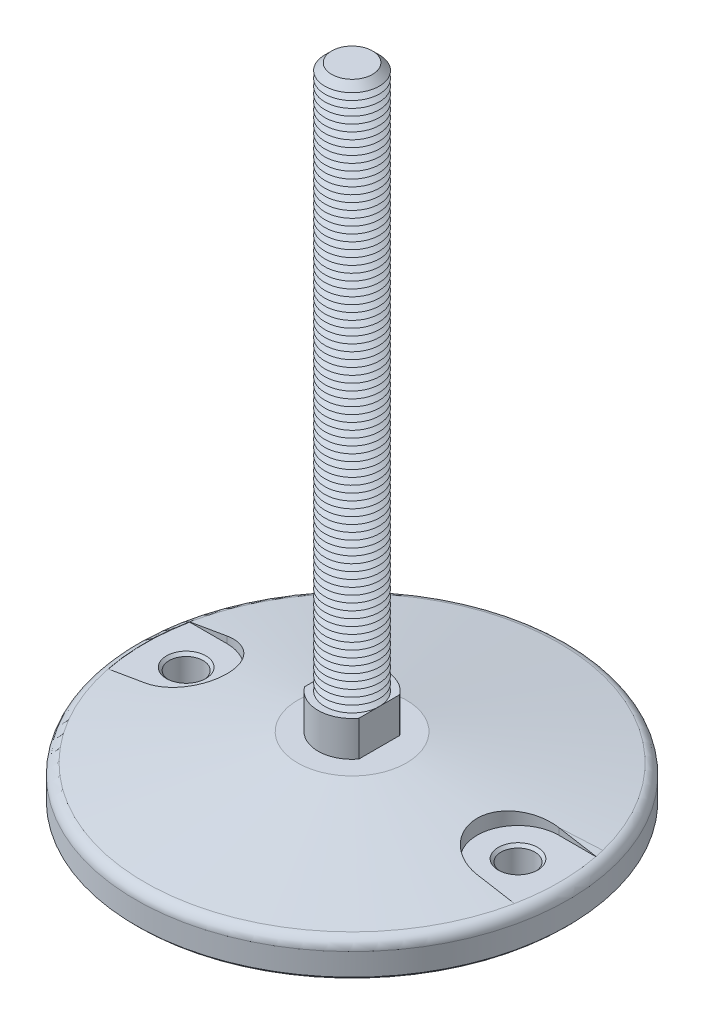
from build123d import *

# Parameters (mm, degrees)
FILLET1_R                = 4
SKETCH3_R                = 12.5
BOSS_EXTRUDE1_DEPTH      = 13
CUT_EXTRUDE1_START       = -13
CUT_EXTRUDE1_DEPTH       = 13
SKETCH5_R                = 10
BOSS_EXTRUDE2_DEPTH      = 200
CHAMFER1_SIZE            = 2.5
LPATTERN1_COUNT          = 79
LPATTERN1_PITCH          = 2.5
CUT_EXTRUDE4_DEPTH       = 10
SKETCH10_R               = 6.25
CUT_EXTRUDE5_DEPTH       = 13
CHAMFER2_SIZE            = 1
CHAMFER2_OF_MIRROR1_SIZE = 1
CHAMFER3_SIZE            = 1


with BuildPart() as part:
    # Sketch2 → Revolve1 (revolve)
    with BuildSketch(Plane(origin=(0, 0, 0), x_dir=(0, 0, -1), z_dir=(1, 0, 0)), mode=Mode.PRIVATE) as revolve1_sk:
        Polygon((0, 0), (-20, 0), (-79.5, -10.491455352), (-79.5, -23), (0, -23), align=None)
    revolve(revolve1_sk.sketch.rotate(Axis((0, 61.338865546, 0), (0, -1, 0)), 180), axis=Axis((0, 61.338865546, 0), (0, -1, 0)))

    # Fillet1
    fillet1_edges = [part.edges().sort_by_distance(p)[0] for p in [
        (0, -10.491455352, 79.5),
    ]]
    fillet(fillet1_edges, radius=FILLET1_R)

    # Sketch3 → Boss-Extrude1 (add)
    with BuildSketch(Plane(origin=(0, 0, 0), x_dir=(1, 0, 0), z_dir=(0, 1, 0))):
        with Locations(Location((0, 0, 0), (0, 0, 90))):
            Circle(SKETCH3_R)
    extrude(amount=BOSS_EXTRUDE1_DEPTH)

    # Sketch4 → Cut-Extrude1 (cut)
    with BuildSketch(Plane(origin=(0, 13, 0), x_dir=(1, 0, 0), z_dir=(0, 1, 0)).offset(CUT_EXTRUDE1_START)):
        with BuildLine():
            Line((-10, 7.5), (-10, -7.5))
            ThreePointArc((-10, -7.5), (-12.5, 0), (-10, 7.5))
        make_face()
        with BuildLine():
            Line((10, -7.5), (10, 7.5))
            ThreePointArc((10, 7.5), (12.5, 0), (10, -7.5))
        make_face()
    extrude(amount=CUT_EXTRUDE1_DEPTH, mode=Mode.SUBTRACT)

    # Sketch5 → Boss-Extrude2 (add)
    with BuildSketch(Plane(origin=(0, 13, 0), x_dir=(1, 0, 0), z_dir=(0, 1, 0))):
        with Locations(Location((0, 0, 0), (0, 0, 180))):
            Circle(SKETCH5_R)
    extrude(amount=BOSS_EXTRUDE2_DEPTH)

    # Chamfer1
    chamfer1_edges = [part.edges().sort_by_distance(p)[0] for p in [
        (10, 213, 0),
    ]]
    chamfer(chamfer1_edges, length=CHAMFER1_SIZE)

    # Sketch6 → Cut-Revolve1 (revolve, cut)
    with BuildSketch(Plane(origin=(0, 0, 0), x_dir=(0, 0, -1), z_dir=(1, 0, 0))):
        Polygon((-10, 13), (-7.834936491, 14.25), (-10, 15.5), align=None)
    cut_revolve1 = revolve(axis=Axis((0, 61.338865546, 0), (0, -1, 0)), mode=Mode.SUBTRACT)

    # LPattern1: Cut-Revolve1 ×79
    with Locations(*[(0, i * LPATTERN1_PITCH, 0) for i in range(1, LPATTERN1_COUNT)]):
        add(cut_revolve1, mode=Mode.SUBTRACT)

    # Sketch8 → Cut-Extrude4 (cut)
    with BuildSketch(Plane(origin=(0, 0, 0), x_dir=(1, 0, 0), z_dir=(0, 1, 0))):
        with BuildLine():
            Line((-61, 15), (-74.703520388, 15))
            ThreePointArc((-74.703520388, 15), (-76.194592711, 0), (-74.703520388, -15))
            Line((-74.703520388, -15), (-61, -15))
            ThreePointArc((-61, -15), (-46, 0), (-61, 15))
        make_face()
    cut_extrude4 = extrude(amount=-CUT_EXTRUDE4_DEPTH, mode=Mode.SUBTRACT)

    # Sketch10 → Cut-Extrude5 (cut)
    with BuildSketch(Plane(origin=(0, -10, 0), x_dir=(1, 0, 0), z_dir=(0, 1, 0))):
        with Locations(Location((-61, 0, 0), (0, 0, 270))):
            Circle(SKETCH10_R)
    cut_extrude5 = extrude(amount=-CUT_EXTRUDE5_DEPTH, mode=Mode.SUBTRACT)

    # Chamfer2
    chamfer2_edges = [part.edges().sort_by_distance(p)[0] for p in [
        (-61, -10, -6.25),
        (-61, -23, -6.25),
    ]]
    chamfer(chamfer2_edges, length=CHAMFER2_SIZE)

    # Mirror1: Cut-Extrude4, Cut-Extrude5 across plane
    add(cut_extrude4.mirror(Plane(origin=(0, 0, 0), x_dir=(0, 0, 1), z_dir=(1, 0, 0))), mode=Mode.SUBTRACT)
    add(cut_extrude5.mirror(Plane(origin=(0, 0, 0), x_dir=(0, 0, 1), z_dir=(1, 0, 0))), mode=Mode.SUBTRACT)

    # Chamfer2 of Mirror1
    chamfer2_of_mirror1_edges = [part.edges().sort_by_distance(p)[0] for p in [
        (61, -10, -6.25),
        (61, -23, -6.25),
    ]]
    chamfer(chamfer2_of_mirror1_edges, length=CHAMFER2_OF_MIRROR1_SIZE)

    # Chamfer3
    chamfer3_edges = [part.edges().sort_by_distance(p)[0] for p in [
        (0, -23, 79.5),
    ]]
    chamfer(chamfer3_edges, length=CHAMFER3_SIZE)


solid = part.part
